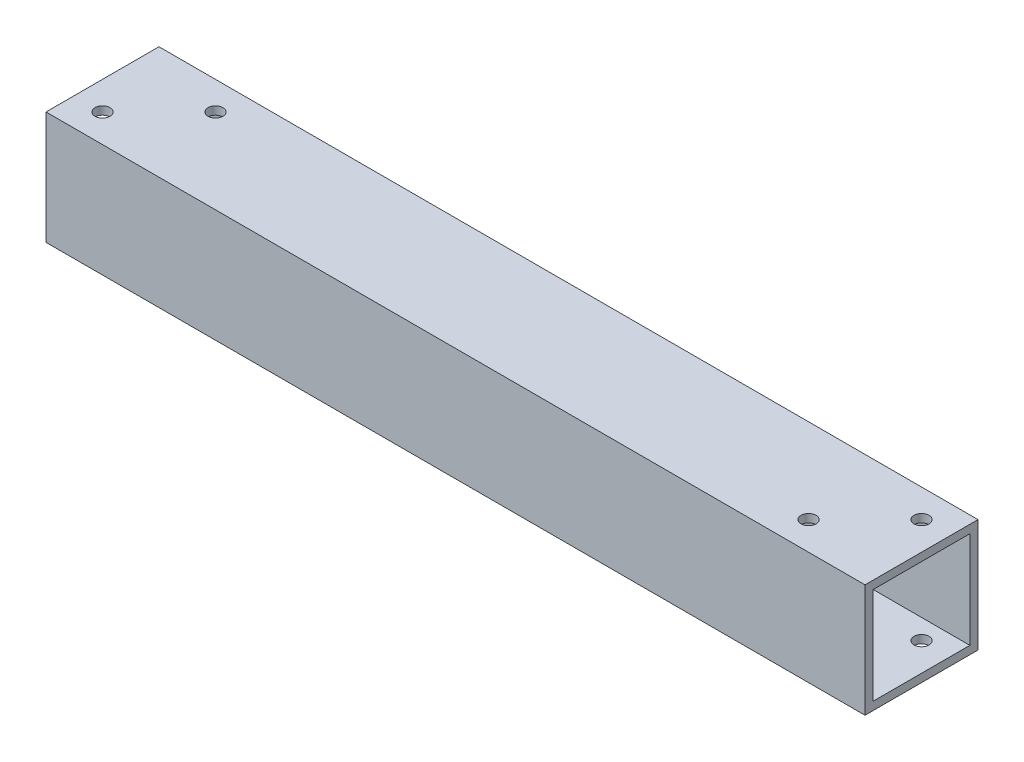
from build123d import *

# Parameters (mm, degrees)
SKETCH1_W          = 50.8
SKETCH1_H          = 50.8
SKETCH1_W_2        = 43.4848
SKETCH1_H_2        = 43.4848
EXTRUDE1_DEPTH     = 368.3
SKETCH3_R          = 3.37312
CUT_EXTRUDE1_DEPTH = 376.241482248


with BuildPart() as part:
    # Sketch1 → Extrude1 (new body)
    with BuildSketch(Plane(origin=(0, 0, 0), x_dir=(0, 0, -1), z_dir=(1, 0, 0))):
        with Locations((25.4, 25.4)):
            Rectangle(SKETCH1_W, SKETCH1_H)
        with Locations((25.4, 25.4)):
            Rectangle(SKETCH1_W_2, SKETCH1_H_2, mode=Mode.SUBTRACT)
    extrude(amount=EXTRUDE1_DEPTH)

    # Sketch3 → Cut-Extrude1 (cut, through all)
    with BuildSketch(Plane(origin=(0, 50.8, 0), x_dir=(1, 0, 0), z_dir=(0, 1, 0))):
        with Locations(Location((12.7, 12.7, 0), (0, 0, 270))):
            Circle(SKETCH3_R)
        with Locations(Location((38.1, 38.1, 0), (0, 0, 270))):
            Circle(SKETCH3_R)
        with Locations(Location((355.6, 38.1, 0), (0, 0, 270))):
            Circle(SKETCH3_R)
        with Locations(Location((330.2, 12.7, 0), (0, 0, 270))):
            Circle(SKETCH3_R)
    extrude(amount=-CUT_EXTRUDE1_DEPTH, mode=Mode.SUBTRACT)


solid = part.part
